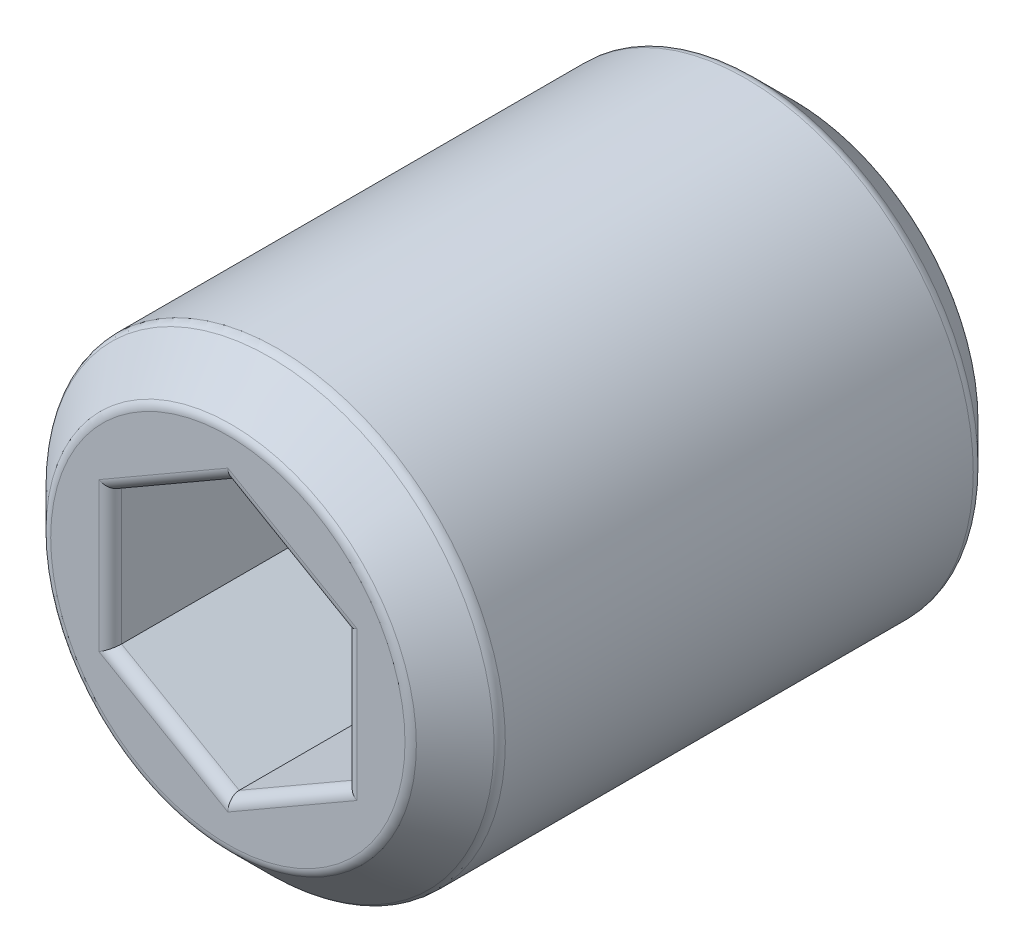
from build123d import *

# Parameters (mm, degrees)
ESQUISSE1_R             = 2
EXTRUSION1_DEPTH        = 5
CHANFREIN1_SIZE         = 0.4
ENL_V_MAT_EXTRU_1_DEPTH = 2
CONG_1_R                = 0.1


with BuildPart() as part:
    # Esquisse1 → Extrusion1 (new body)
    with BuildSketch(Plane.XY):
        with Locations(Location((0, 0, 0), (0, 0, 180))):
            Circle(ESQUISSE1_R)
    extrude(amount=EXTRUSION1_DEPTH)

    # Chanfrein1
    chanfrein1_edges = [part.edges().sort_by_distance(p)[0] for p in [
        (2, 0, 0),
        (2, 0, 5),
    ]]
    chamfer(chanfrein1_edges, length=CHANFREIN1_SIZE)

    # Esquisse2 → Enl_v. mat.-Extru.1 (cut)
    with BuildSketch(Plane.XY.offset(5)):
        Polygon((0, 1.194901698), (-1.034815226, 0.597450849), (-1.034815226, -0.597450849), (0, -1.194901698), (1.034815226, -0.597450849), (1.034815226, 0.597450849), align=None)
    extrude(amount=-ENL_V_MAT_EXTRU_1_DEPTH, mode=Mode.SUBTRACT)

    # Cong_1
    cong_1_edges = [part.edges().sort_by_distance(p)[0] for p in [
        (2, 0, 0.4),
        (2, 0, 4.6),
        (1.6, 0, 0),
        (1.6, 0, 5),
        (-0.517407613, 0.896176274, 5),
        (-1.034815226, 0, 5),
        (-0.517407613, -0.896176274, 5),
        (0.517407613, -0.896176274, 5),
        (1.034815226, 0, 5),
        (0.517407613, 0.896176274, 5),
    ]]
    fillet(cong_1_edges, radius=CONG_1_R)


solid = part.part
